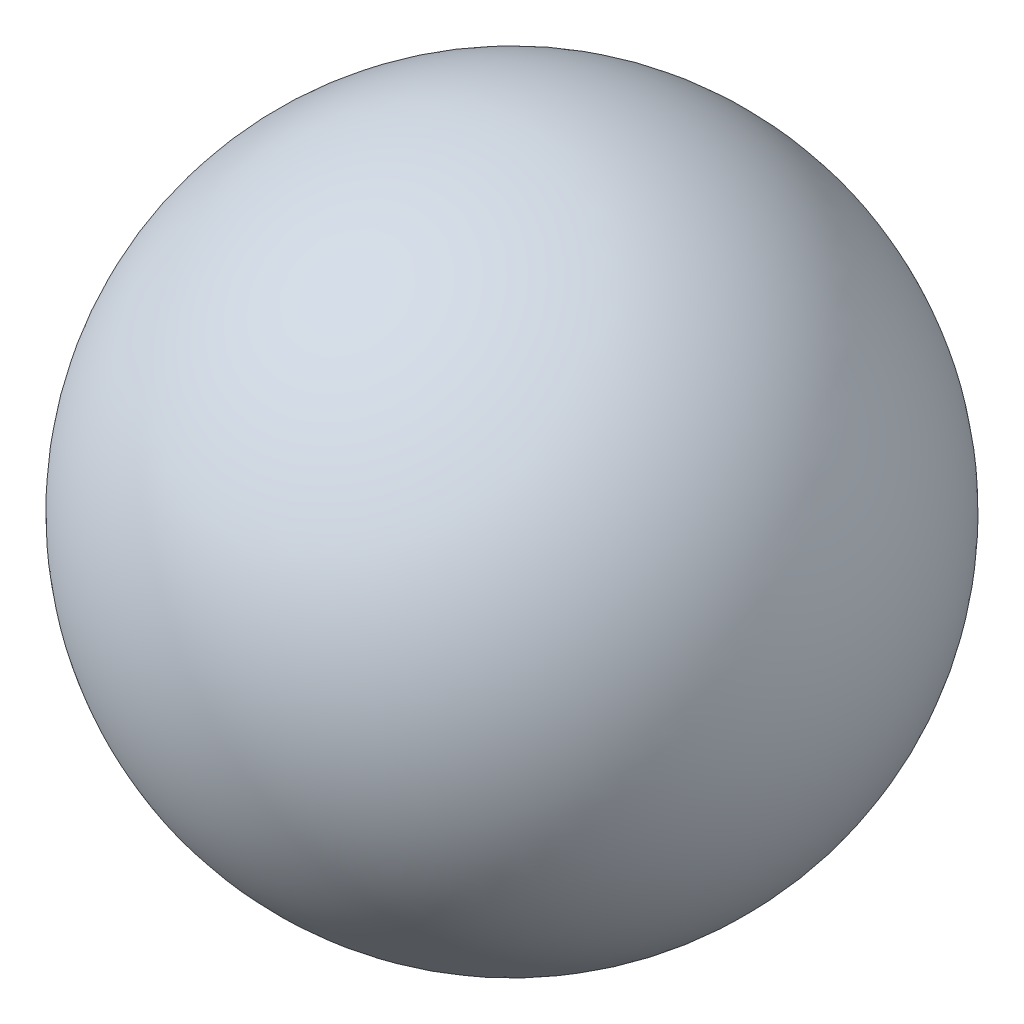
ISO-10303-21;
HEADER;
FILE_DESCRIPTION(('STEP AP214'),'2;1');
FILE_NAME('part.step','',(''),(''),'','','');
FILE_SCHEMA(('AUTOMOTIVE_DESIGN { 1 0 10303 214 1 1 1 1 }'));
ENDSEC;
DATA;
#1=APPLICATION_CONTEXT('core data for automotive mechanical design processes');
#2=APPLICATION_PROTOCOL_DEFINITION('international standard','automotive_design',2000,#1);
#3=PRODUCT_CONTEXT('',#1,'mechanical');
#4=PRODUCT('Part','Part','',(#3));
#5=PRODUCT_RELATED_PRODUCT_CATEGORY('part','',(#4));
#6=PRODUCT_DEFINITION_FORMATION('','',#4);
#7=PRODUCT_DEFINITION_CONTEXT('part definition',#1,'design');
#8=PRODUCT_DEFINITION('design','',#6,#7);
#9=PRODUCT_DEFINITION_SHAPE('','',#8);
#10=(LENGTH_UNIT() NAMED_UNIT(*) SI_UNIT(.MILLI.,.METRE.));
#11=(NAMED_UNIT(*) PLANE_ANGLE_UNIT() SI_UNIT($,.RADIAN.));
#12=(NAMED_UNIT(*) SI_UNIT($,.STERADIAN.) SOLID_ANGLE_UNIT());
#13=UNCERTAINTY_MEASURE_WITH_UNIT(LENGTH_MEASURE(1.E-05),#10,'distance_accuracy_value','');
#14=(GEOMETRIC_REPRESENTATION_CONTEXT(3) GLOBAL_UNCERTAINTY_ASSIGNED_CONTEXT((#13)) GLOBAL_UNIT_ASSIGNED_CONTEXT((#10,
#11,#12)) REPRESENTATION_CONTEXT('',''));
#15=CARTESIAN_POINT('',(0.,0.,0.));
#16=DIRECTION('',(0.,0.,1.));
#17=DIRECTION('',(1.,0.,0.));
#18=AXIS2_PLACEMENT_3D('',#15,#16,#17);
#19=CARTESIAN_POINT('',(0.,0.,0.));
#20=DIRECTION('',(0.,0.,-1.));
#21=DIRECTION('',(1.,0.,0.));
#22=AXIS2_PLACEMENT_3D('',#19,#20,#21);
#23=SPHERICAL_SURFACE('',#22,33.5);
#24=CARTESIAN_POINT('',(0.,0.,-33.5));
#25=VERTEX_POINT('',#24);
#26=VERTEX_LOOP('',#25);
#27=FACE_BOUND('',#26,.T.);
#28=ADVANCED_FACE('F38',(#27),#23,.T.);
#29=CLOSED_SHELL('',(#28));
#30=CARTESIAN_POINT('',(0.,0.,0.));
#31=DIRECTION('',(0.,0.,-1.));
#32=DIRECTION('',(1.,0.,0.));
#33=AXIS2_PLACEMENT_3D('',#30,#31,#32);
#34=SPHERICAL_SURFACE('',#33,30.);
#35=CARTESIAN_POINT('',(0.,0.,-30.));
#36=VERTEX_POINT('',#35);
#37=VERTEX_LOOP('',#36);
#38=FACE_BOUND('',#37,.T.);
#39=ADVANCED_FACE('F51',(#38),#34,.F.);
#40=CLOSED_SHELL('',(#39));
#41=ORIENTED_CLOSED_SHELL('',*,#40,.T.);
#42=BREP_WITH_VOIDS('B2',#29,(#41));
#43=ADVANCED_BREP_SHAPE_REPRESENTATION('',(#18,#42),#14);
#44=SHAPE_DEFINITION_REPRESENTATION(#9,#43);
ENDSEC;
END-ISO-10303-21;
